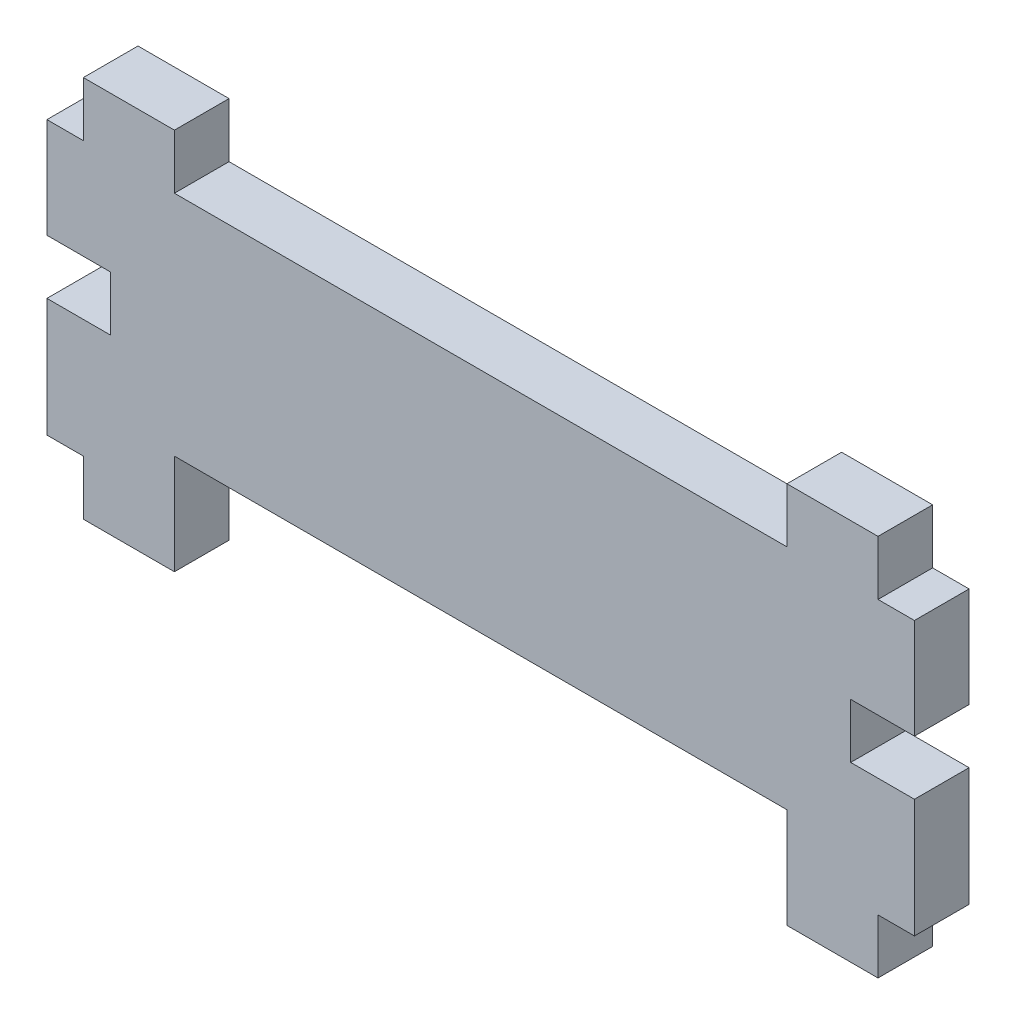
from build123d import *

# Parameters (mm, degrees)
SALIENTE_EXTRUIR1_DEPTH = 3


with BuildPart() as part:
    # Croquis1 → Saliente-Extruir1 (new body)
    with BuildSketch(Plane.XY):
        Polygon((-10.57873839, -2.314080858), (-12.57873839, -2.314080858), (-12.57873839, -7.814080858), (-9.07873839, -7.814080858), (-9.07873839, -10.814080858), (-12.57873839, -10.814080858), (-12.57873839, -17.314080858), (-10.57873839, -17.314080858), (-10.57873839, -20.314080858), (-5.57873839, -20.314080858), (-5.57873839, -17.314080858), (-5.57873839, -14.814080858), (28.05126161, -14.814080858), (28.05126161, -17.314080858), (28.05126161, -20.314080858), (33.05126161, -20.314080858), (33.05126161, -17.314080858), (35.05126161, -17.314080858), (35.05126161, -10.814080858), (31.55126161, -10.814080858), (31.55126161, -7.814080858), (35.05126161, -7.814080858), (35.05126161, -2.314080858), (33.05126161, -2.314080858), (33.05126161, 0.685919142), (28.05126161, 0.685919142), (28.05126161, -2.314080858), (-5.57873839, -2.314080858), (-5.57873839, 0.685919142), (-10.57873839, 0.685919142), align=None)
    extrude(amount=SALIENTE_EXTRUIR1_DEPTH)


solid = part.part
